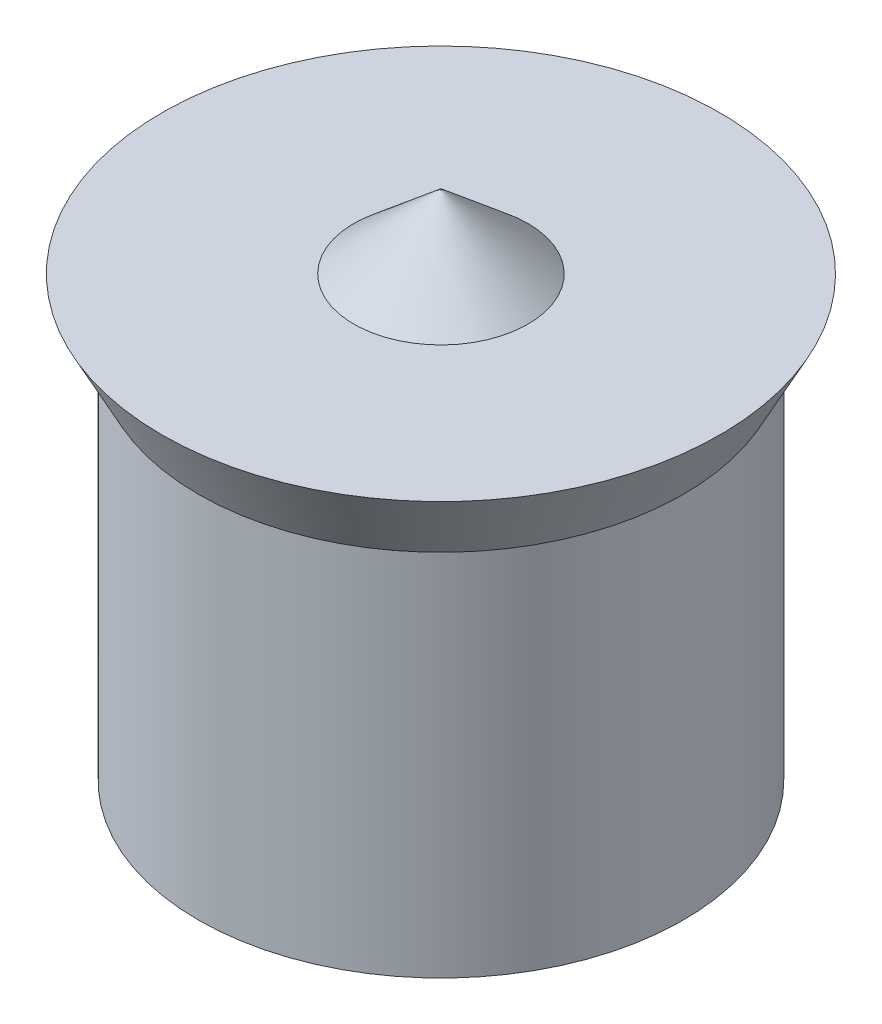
from build123d import *

# Parameters (mm, degrees)
SKETCH1_R           = 36.5
BOSS_EXTRUDE1_DEPTH = 55.5
SKETCH2_R           = 42
SKETCH3_R           = 2.5
SKETCH5_R           = 13.120064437
SKETCH4_R           = 0.117250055


with BuildPart() as part:
    # Sketch1 → Boss-Extrude1 (new body)
    with BuildSketch(Plane(origin=(0, 0, 0), x_dir=(1, 0, 0), z_dir=(0, 1, 0))):
        with Locations(Location((0, 0, 0), (0, 0, 270))):
            Circle(SKETCH1_R)
    extrude(amount=BOSS_EXTRUDE1_DEPTH)

    # Sketch2 → section 1 of loft3
    with BuildSketch(Plane(origin=(0, 66, 0), x_dir=(1, 0, 0), z_dir=(0, 1, 0)), mode=Mode.PRIVATE) as loft3_s1:
        Circle(SKETCH2_R)
    # loft from a face of the part (loft3)
    loft([part.faces().sort_by_distance((0, 55.5, 0))[0], loft3_s1.sketch])

    # Sketch3 → section 1 of loft4
    with BuildSketch(Plane(origin=(0, -21, 0), x_dir=(-1, 0, 0), z_dir=(0, -1, 0)), mode=Mode.PRIVATE) as loft4_s1:
        Circle(SKETCH3_R)
    # loft from a face of the part (loft4)
    loft([part.faces().sort_by_distance((0, 0, 0))[0], loft4_s1.sketch])

    # Sketch5 → Loft5 section 0
    with BuildSketch(Plane(origin=(0, 66, 0), x_dir=(1, 0, 0), z_dir=(0, 1, 0))):
        Circle(SKETCH5_R)
    # Sketch4 → Loft5 section 1
    with BuildSketch(Plane(origin=(0, 77, 0), x_dir=(-1, 0, 0), z_dir=(0, -1, 0))):
        Circle(SKETCH4_R)
    loft()


solid = part.part
